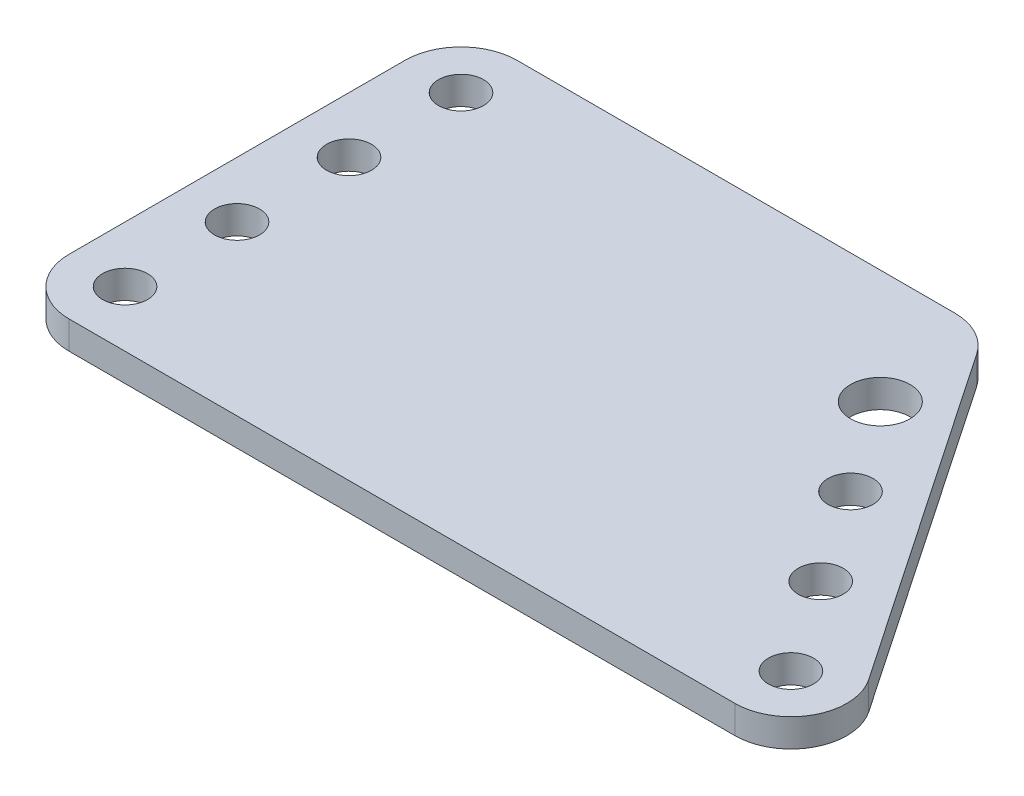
ISO-10303-21;
HEADER;
FILE_DESCRIPTION(('STEP AP214'),'2;1');
FILE_NAME('part.step','',(''),(''),'','','');
FILE_SCHEMA(('AUTOMOTIVE_DESIGN { 1 0 10303 214 1 1 1 1 }'));
ENDSEC;
DATA;
#1=APPLICATION_CONTEXT('core data for automotive mechanical design processes');
#2=APPLICATION_PROTOCOL_DEFINITION('international standard','automotive_design',2000,#1);
#3=PRODUCT_CONTEXT('',#1,'mechanical');
#4=PRODUCT('Part','Part','',(#3));
#5=PRODUCT_RELATED_PRODUCT_CATEGORY('part','',(#4));
#6=PRODUCT_DEFINITION_FORMATION('','',#4);
#7=PRODUCT_DEFINITION_CONTEXT('part definition',#1,'design');
#8=PRODUCT_DEFINITION('design','',#6,#7);
#9=PRODUCT_DEFINITION_SHAPE('','',#8);
#10=(LENGTH_UNIT() NAMED_UNIT(*) SI_UNIT(.MILLI.,.METRE.));
#11=(NAMED_UNIT(*) PLANE_ANGLE_UNIT() SI_UNIT($,.RADIAN.));
#12=(NAMED_UNIT(*) SI_UNIT($,.STERADIAN.) SOLID_ANGLE_UNIT());
#13=UNCERTAINTY_MEASURE_WITH_UNIT(LENGTH_MEASURE(1.E-05),#10,'distance_accuracy_value','');
#14=(GEOMETRIC_REPRESENTATION_CONTEXT(3) GLOBAL_UNCERTAINTY_ASSIGNED_CONTEXT((#13)) GLOBAL_UNIT_ASSIGNED_CONTEXT((#10,
#11,#12)) REPRESENTATION_CONTEXT('',''));
#15=CARTESIAN_POINT('',(0.,0.,0.));
#16=DIRECTION('',(0.,0.,1.));
#17=DIRECTION('',(1.,0.,0.));
#18=AXIS2_PLACEMENT_3D('',#15,#16,#17);
#19=CARTESIAN_POINT('',(6.35,0.,-6.35));
#20=DIRECTION('',(0.,-1.,0.));
#21=DIRECTION('',(0.,0.,-1.));
#22=AXIS2_PLACEMENT_3D('',#19,#20,#21);
#23=PLANE('',#22);
#24=CARTESIAN_POINT('',(60.4719283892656,0.,-37.8774597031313));
#25=DIRECTION('',(0.,1.,0.));
#26=DIRECTION('',(0.,0.,1.));
#27=AXIS2_PLACEMENT_3D('',#24,#25,#26);
#28=CIRCLE('',#27,3.37350099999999);
#29=CARTESIAN_POINT('',(60.4719283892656,0.,-34.5039587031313));
#30=VERTEX_POINT('',#29);
#31=EDGE_CURVE('E275',#30,#30,#28,.T.);
#32=ORIENTED_EDGE('',*,*,#31,.T.);
#33=EDGE_LOOP('',(#32));
#34=FACE_BOUND('',#33,.T.);
#35=CARTESIAN_POINT('',(6.35,0.,-44.45));
#36=DIRECTION('',(0.,1.,0.));
#37=DIRECTION('',(0.,0.,1.));
#38=AXIS2_PLACEMENT_3D('',#35,#36,#37);
#39=CIRCLE('',#38,2.55269999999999);
#40=CARTESIAN_POINT('',(6.35,0.,-41.8973));
#41=VERTEX_POINT('',#40);
#42=EDGE_CURVE('E267',#41,#41,#39,.T.);
#43=ORIENTED_EDGE('',*,*,#42,.T.);
#44=EDGE_LOOP('',(#43));
#45=FACE_BOUND('',#44,.T.);
#46=CARTESIAN_POINT('',(6.35000000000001,0.,-6.35));
#47=DIRECTION('',(0.,1.,0.));
#48=DIRECTION('',(0.,0.,1.));
#49=AXIS2_PLACEMENT_3D('',#46,#47,#48);
#50=CIRCLE('',#49,2.5527);
#51=CARTESIAN_POINT('',(6.35000000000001,0.,-3.7973));
#52=VERTEX_POINT('',#51);
#53=EDGE_CURVE('E259',#52,#52,#50,.T.);
#54=ORIENTED_EDGE('',*,*,#53,.T.);
#55=EDGE_LOOP('',(#54));
#56=FACE_BOUND('',#55,.T.);
#57=CARTESIAN_POINT('',(81.8642,0.,-6.35));
#58=DIRECTION('',(0.,1.,0.));
#59=DIRECTION('',(0.,0.,1.));
#60=AXIS2_PLACEMENT_3D('',#57,#58,#59);
#61=CIRCLE('',#60,2.55269999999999);
#62=CARTESIAN_POINT('',(81.8642,0.,-3.79730000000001));
#63=VERTEX_POINT('',#62);
#64=EDGE_CURVE('E251',#63,#63,#61,.T.);
#65=ORIENTED_EDGE('',*,*,#64,.T.);
#66=EDGE_LOOP('',(#65));
#67=FACE_BOUND('',#66,.T.);
#68=CARTESIAN_POINT('',(6.35,0.,-19.05));
#69=DIRECTION('',(0.,1.,0.));
#70=DIRECTION('',(0.,0.,1.));
#71=AXIS2_PLACEMENT_3D('',#68,#69,#70);
#72=CIRCLE('',#71,2.55269999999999);
#73=CARTESIAN_POINT('',(6.35,0.,-16.4973));
#74=VERTEX_POINT('',#73);
#75=EDGE_CURVE('E243',#74,#74,#72,.T.);
#76=ORIENTED_EDGE('',*,*,#75,.T.);
#77=EDGE_LOOP('',(#76));
#78=FACE_BOUND('',#77,.T.);
#79=CARTESIAN_POINT('',(6.35,0.,-31.75));
#80=DIRECTION('',(0.,1.,0.));
#81=DIRECTION('',(0.,0.,1.));
#82=AXIS2_PLACEMENT_3D('',#79,#80,#81);
#83=CIRCLE('',#82,2.5527);
#84=CARTESIAN_POINT('',(6.35,0.,-29.1973));
#85=VERTEX_POINT('',#84);
#86=EDGE_CURVE('E235',#85,#85,#83,.T.);
#87=ORIENTED_EDGE('',*,*,#86,.T.);
#88=EDGE_LOOP('',(#87));
#89=FACE_BOUND('',#88,.T.);
#90=CARTESIAN_POINT('',(67.6026855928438,0.,-27.3683064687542));
#91=DIRECTION('',(0.,1.,0.));
#92=DIRECTION('',(0.,0.,1.));
#93=AXIS2_PLACEMENT_3D('',#90,#91,#92);
#94=CIRCLE('',#93,2.55269999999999);
#95=CARTESIAN_POINT('',(67.6026855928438,0.,-24.8156064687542));
#96=VERTEX_POINT('',#95);
#97=EDGE_CURVE('E227',#96,#96,#94,.T.);
#98=ORIENTED_EDGE('',*,*,#97,.T.);
#99=EDGE_LOOP('',(#98));
#100=FACE_BOUND('',#99,.T.);
#101=CARTESIAN_POINT('',(6.35,0.,-6.35));
#102=DIRECTION('',(0.,1.,0.));
#103=DIRECTION('',(0.,0.,-1.));
#104=AXIS2_PLACEMENT_3D('',#101,#102,#103);
#105=CIRCLE('',#104,6.35);
#106=CARTESIAN_POINT('',(0.,0.,-6.35000000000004));
#107=VERTEX_POINT('',#106);
#108=CARTESIAN_POINT('',(6.35000000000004,0.,0.));
#109=VERTEX_POINT('',#108);
#110=EDGE_CURVE('E151',#107,#109,#105,.T.);
#111=ORIENTED_EDGE('',*,*,#110,.F.);
#112=DIRECTION('',(0.,0.,1.));
#113=VECTOR('',#112,1.);
#114=CARTESIAN_POINT('',(0.,0.,-44.45));
#115=LINE('',#114,#113);
#116=CARTESIAN_POINT('',(0.,0.,-44.45));
#117=VERTEX_POINT('',#116);
#118=EDGE_CURVE('E101',#117,#107,#115,.T.);
#119=ORIENTED_EDGE('',*,*,#118,.F.);
#120=CARTESIAN_POINT('',(6.35,0.,-44.45));
#121=DIRECTION('',(0.,1.,0.));
#122=DIRECTION('',(0.,0.,1.));
#123=AXIS2_PLACEMENT_3D('',#120,#121,#122);
#124=CIRCLE('',#123,6.35);
#125=CARTESIAN_POINT('',(6.35000000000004,0.,-50.8));
#126=VERTEX_POINT('',#125);
#127=EDGE_CURVE('E95',#126,#117,#124,.T.);
#128=ORIENTED_EDGE('',*,*,#127,.F.);
#129=DIRECTION('',(-1.,0.,0.));
#130=VECTOR('',#129,1.);
#131=CARTESIAN_POINT('',(56.0122742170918,0.,-50.8));
#132=LINE('',#131,#130);
#133=CARTESIAN_POINT('',(56.0122742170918,0.,-50.8));
#134=VERTEX_POINT('',#133);
#135=EDGE_CURVE('E137',#134,#126,#132,.T.);
#136=ORIENTED_EDGE('',*,*,#135,.F.);
#137=CARTESIAN_POINT('',(56.0122742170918,0.,-44.45));
#138=DIRECTION('',(0.,1.,0.));
#139=DIRECTION('',(0.,0.,1.));
#140=AXIS2_PLACEMENT_3D('',#137,#138,#139);
#141=CIRCLE('',#140,6.34999999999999);
#142=CARTESIAN_POINT('',(61.2668508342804,0.,-48.0153786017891));
#143=VERTEX_POINT('',#142);
#144=EDGE_CURVE('E165',#143,#134,#141,.T.);
#145=ORIENTED_EDGE('',*,*,#144,.F.);
#146=DIRECTION('',(-0.561476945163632,0.,-0.827492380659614));
#147=VECTOR('',#146,1.);
#148=CARTESIAN_POINT('',(87.1187766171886,0.,-9.91537860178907));
#149=LINE('',#148,#147);
#150=CARTESIAN_POINT('',(87.1187766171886,0.,-9.91537860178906));
#151=VERTEX_POINT('',#150);
#152=EDGE_CURVE('E162',#151,#143,#149,.T.);
#153=ORIENTED_EDGE('',*,*,#152,.F.);
#154=CARTESIAN_POINT('',(81.8642,0.,-6.35));
#155=DIRECTION('',(0.,1.,0.));
#156=DIRECTION('',(0.,0.,1.));
#157=AXIS2_PLACEMENT_3D('',#154,#155,#156);
#158=CIRCLE('',#157,6.35000000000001);
#159=CARTESIAN_POINT('',(81.8642,0.,0.));
#160=VERTEX_POINT('',#159);
#161=EDGE_CURVE('E159',#160,#151,#158,.T.);
#162=ORIENTED_EDGE('',*,*,#161,.F.);
#163=DIRECTION('',(1.,0.,0.));
#164=VECTOR('',#163,1.);
#165=CARTESIAN_POINT('',(6.35000000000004,0.,0.));
#166=LINE('',#165,#164);
#167=EDGE_CURVE('E155',#109,#160,#166,.T.);
#168=ORIENTED_EDGE('',*,*,#167,.F.);
#169=EDGE_LOOP('',(#111,#119,#128,#136,#145,#153,#162,#168));
#170=FACE_BOUND('',#169,.T.);
#171=CARTESIAN_POINT('',(74.7334427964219,0.,-16.8591532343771));
#172=DIRECTION('',(0.,1.,0.));
#173=DIRECTION('',(0.,0.,1.));
#174=AXIS2_PLACEMENT_3D('',#171,#172,#173);
#175=CIRCLE('',#174,2.55269999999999);
#176=CARTESIAN_POINT('',(74.7334427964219,0.,-14.3064532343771));
#177=VERTEX_POINT('',#176);
#178=EDGE_CURVE('E156',#177,#177,#175,.T.);
#179=ORIENTED_EDGE('',*,*,#178,.T.);
#180=EDGE_LOOP('',(#179));
#181=FACE_BOUND('',#180,.T.);
#182=ADVANCED_FACE('F48',(#34,#45,#56,#67,#78,#89,#100,#170,#181),#23,.T.);
#183=CARTESIAN_POINT('',(6.35,3.175,-6.35));
#184=DIRECTION('',(0.,-1.,0.));
#185=DIRECTION('',(0.,0.,-1.));
#186=AXIS2_PLACEMENT_3D('',#183,#184,#185);
#187=CYLINDRICAL_SURFACE('',#186,6.35);
#188=ORIENTED_EDGE('',*,*,#110,.T.);
#189=DIRECTION('',(0.,-1.,0.));
#190=VECTOR('',#189,1.);
#191=CARTESIAN_POINT('',(6.35000000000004,3.175,0.));
#192=LINE('',#191,#190);
#193=CARTESIAN_POINT('',(6.35000000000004,3.175,0.));
#194=VERTEX_POINT('',#193);
#195=EDGE_CURVE('E13',#194,#109,#192,.T.);
#196=ORIENTED_EDGE('',*,*,#195,.F.);
#197=CARTESIAN_POINT('',(6.35,3.175,-6.35));
#198=DIRECTION('',(0.,1.,0.));
#199=DIRECTION('',(0.,0.,-1.));
#200=AXIS2_PLACEMENT_3D('',#197,#198,#199);
#201=CIRCLE('',#200,6.35);
#202=CARTESIAN_POINT('',(0.,3.175,-6.35000000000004));
#203=VERTEX_POINT('',#202);
#204=EDGE_CURVE('E174',#203,#194,#201,.T.);
#205=ORIENTED_EDGE('',*,*,#204,.F.);
#206=DIRECTION('',(0.,-1.,0.));
#207=VECTOR('',#206,1.);
#208=CARTESIAN_POINT('',(0.,3.175,-6.35000000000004));
#209=LINE('',#208,#207);
#210=EDGE_CURVE('E147',#203,#107,#209,.T.);
#211=ORIENTED_EDGE('',*,*,#210,.T.);
#212=EDGE_LOOP('',(#188,#196,#205,#211));
#213=FACE_BOUND('',#212,.T.);
#214=ADVANCED_FACE('F50',(#213),#187,.T.);
#215=CARTESIAN_POINT('',(6.35000000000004,3.175,0.));
#216=DIRECTION('',(0.,0.,-1.));
#217=DIRECTION('',(-1.,0.,0.));
#218=AXIS2_PLACEMENT_3D('',#215,#216,#217);
#219=PLANE('',#218);
#220=ORIENTED_EDGE('',*,*,#167,.T.);
#221=DIRECTION('',(0.,-1.,0.));
#222=VECTOR('',#221,1.);
#223=CARTESIAN_POINT('',(81.8642,3.175,0.));
#224=LINE('',#223,#222);
#225=CARTESIAN_POINT('',(81.8642,3.175,0.));
#226=VERTEX_POINT('',#225);
#227=EDGE_CURVE('E58',#226,#160,#224,.T.);
#228=ORIENTED_EDGE('',*,*,#227,.F.);
#229=DIRECTION('',(1.,0.,0.));
#230=VECTOR('',#229,1.);
#231=CARTESIAN_POINT('',(6.35000000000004,3.175,0.));
#232=LINE('',#231,#230);
#233=EDGE_CURVE('E109',#194,#226,#232,.T.);
#234=ORIENTED_EDGE('',*,*,#233,.F.);
#235=ORIENTED_EDGE('',*,*,#195,.T.);
#236=EDGE_LOOP('',(#220,#228,#234,#235));
#237=FACE_BOUND('',#236,.T.);
#238=ADVANCED_FACE('F323',(#237),#219,.F.);
#239=CARTESIAN_POINT('',(81.8642,3.175,-6.35));
#240=DIRECTION('',(0.,-1.,0.));
#241=DIRECTION('',(0.,0.,-1.));
#242=AXIS2_PLACEMENT_3D('',#239,#240,#241);
#243=CYLINDRICAL_SURFACE('',#242,6.35000000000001);
#244=ORIENTED_EDGE('',*,*,#161,.T.);
#245=DIRECTION('',(0.,-1.,0.));
#246=VECTOR('',#245,1.);
#247=CARTESIAN_POINT('',(87.1187766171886,3.175,-9.91537860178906));
#248=LINE('',#247,#246);
#249=CARTESIAN_POINT('',(87.1187766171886,3.175,-9.91537860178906));
#250=VERTEX_POINT('',#249);
#251=EDGE_CURVE('E185',#250,#151,#248,.T.);
#252=ORIENTED_EDGE('',*,*,#251,.F.);
#253=CARTESIAN_POINT('',(81.8642,3.175,-6.35));
#254=DIRECTION('',(0.,1.,0.));
#255=DIRECTION('',(0.,0.,1.));
#256=AXIS2_PLACEMENT_3D('',#253,#254,#255);
#257=CIRCLE('',#256,6.35000000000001);
#258=EDGE_CURVE('E196',#226,#250,#257,.T.);
#259=ORIENTED_EDGE('',*,*,#258,.F.);
#260=ORIENTED_EDGE('',*,*,#227,.T.);
#261=EDGE_LOOP('',(#244,#252,#259,#260));
#262=FACE_BOUND('',#261,.T.);
#263=ADVANCED_FACE('F194',(#262),#243,.T.);
#264=CARTESIAN_POINT('',(87.1187766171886,3.175,-9.91537860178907));
#265=DIRECTION('',(-0.827492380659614,0.,0.561476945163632));
#266=DIRECTION('',(0.561476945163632,0.,0.827492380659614));
#267=AXIS2_PLACEMENT_3D('',#264,#265,#266);
#268=PLANE('',#267);
#269=ORIENTED_EDGE('',*,*,#152,.T.);
#270=DIRECTION('',(0.,-1.,0.));
#271=VECTOR('',#270,1.);
#272=CARTESIAN_POINT('',(61.2668508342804,3.175,-48.0153786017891));
#273=LINE('',#272,#271);
#274=CARTESIAN_POINT('',(61.2668508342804,3.175,-48.0153786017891));
#275=VERTEX_POINT('',#274);
#276=EDGE_CURVE('E181',#275,#143,#273,.T.);
#277=ORIENTED_EDGE('',*,*,#276,.F.);
#278=DIRECTION('',(-0.561476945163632,0.,-0.827492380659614));
#279=VECTOR('',#278,1.);
#280=CARTESIAN_POINT('',(87.1187766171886,3.175,-9.91537860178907));
#281=LINE('',#280,#279);
#282=EDGE_CURVE('E209',#250,#275,#281,.T.);
#283=ORIENTED_EDGE('',*,*,#282,.F.);
#284=ORIENTED_EDGE('',*,*,#251,.T.);
#285=EDGE_LOOP('',(#269,#277,#283,#284));
#286=FACE_BOUND('',#285,.T.);
#287=ADVANCED_FACE('F204',(#286),#268,.F.);
#288=CARTESIAN_POINT('',(56.0122742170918,3.175,-44.45));
#289=DIRECTION('',(0.,-1.,0.));
#290=DIRECTION('',(0.,0.,-1.));
#291=AXIS2_PLACEMENT_3D('',#288,#289,#290);
#292=CYLINDRICAL_SURFACE('',#291,6.34999999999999);
#293=ORIENTED_EDGE('',*,*,#144,.T.);
#294=DIRECTION('',(0.,-1.,0.));
#295=VECTOR('',#294,1.);
#296=CARTESIAN_POINT('',(56.0122742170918,3.175,-50.8));
#297=LINE('',#296,#295);
#298=CARTESIAN_POINT('',(56.0122742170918,3.175,-50.8));
#299=VERTEX_POINT('',#298);
#300=EDGE_CURVE('E139',#299,#134,#297,.T.);
#301=ORIENTED_EDGE('',*,*,#300,.F.);
#302=CARTESIAN_POINT('',(56.0122742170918,3.175,-44.45));
#303=DIRECTION('',(0.,1.,0.));
#304=DIRECTION('',(0.,0.,1.));
#305=AXIS2_PLACEMENT_3D('',#302,#303,#304);
#306=CIRCLE('',#305,6.34999999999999);
#307=EDGE_CURVE('E128',#275,#299,#306,.T.);
#308=ORIENTED_EDGE('',*,*,#307,.F.);
#309=ORIENTED_EDGE('',*,*,#276,.T.);
#310=EDGE_LOOP('',(#293,#301,#308,#309));
#311=FACE_BOUND('',#310,.T.);
#312=ADVANCED_FACE('F207',(#311),#292,.T.);
#313=CARTESIAN_POINT('',(56.0122742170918,3.175,-50.8));
#314=DIRECTION('',(0.,0.,1.));
#315=DIRECTION('',(1.,0.,0.));
#316=AXIS2_PLACEMENT_3D('',#313,#314,#315);
#317=PLANE('',#316);
#318=ORIENTED_EDGE('',*,*,#135,.T.);
#319=DIRECTION('',(0.,-1.,0.));
#320=VECTOR('',#319,1.);
#321=CARTESIAN_POINT('',(6.35000000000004,3.175,-50.8));
#322=LINE('',#321,#320);
#323=CARTESIAN_POINT('',(6.35000000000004,3.175,-50.8));
#324=VERTEX_POINT('',#323);
#325=EDGE_CURVE('E134',#324,#126,#322,.T.);
#326=ORIENTED_EDGE('',*,*,#325,.F.);
#327=DIRECTION('',(-1.,0.,0.));
#328=VECTOR('',#327,1.);
#329=CARTESIAN_POINT('',(56.0122742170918,3.175,-50.8));
#330=LINE('',#329,#328);
#331=EDGE_CURVE('E122',#299,#324,#330,.T.);
#332=ORIENTED_EDGE('',*,*,#331,.F.);
#333=ORIENTED_EDGE('',*,*,#300,.T.);
#334=EDGE_LOOP('',(#318,#326,#332,#333));
#335=FACE_BOUND('',#334,.T.);
#336=ADVANCED_FACE('F135',(#335),#317,.F.);
#337=CARTESIAN_POINT('',(6.35,3.175,-44.45));
#338=DIRECTION('',(0.,-1.,0.));
#339=DIRECTION('',(0.,0.,-1.));
#340=AXIS2_PLACEMENT_3D('',#337,#338,#339);
#341=CYLINDRICAL_SURFACE('',#340,6.35);
#342=ORIENTED_EDGE('',*,*,#127,.T.);
#343=DIRECTION('',(0.,-1.,0.));
#344=VECTOR('',#343,1.);
#345=CARTESIAN_POINT('',(0.,3.175,-44.45));
#346=LINE('',#345,#344);
#347=CARTESIAN_POINT('',(0.,3.175,-44.45));
#348=VERTEX_POINT('',#347);
#349=EDGE_CURVE('E140',#348,#117,#346,.T.);
#350=ORIENTED_EDGE('',*,*,#349,.F.);
#351=CARTESIAN_POINT('',(6.35,3.175,-44.45));
#352=DIRECTION('',(0.,1.,0.));
#353=DIRECTION('',(0.,0.,1.));
#354=AXIS2_PLACEMENT_3D('',#351,#352,#353);
#355=CIRCLE('',#354,6.35);
#356=EDGE_CURVE('E126',#324,#348,#355,.T.);
#357=ORIENTED_EDGE('',*,*,#356,.F.);
#358=ORIENTED_EDGE('',*,*,#325,.T.);
#359=EDGE_LOOP('',(#342,#350,#357,#358));
#360=FACE_BOUND('',#359,.T.);
#361=ADVANCED_FACE('F142',(#360),#341,.T.);
#362=CARTESIAN_POINT('',(0.,3.175,-44.45));
#363=DIRECTION('',(1.,0.,0.));
#364=DIRECTION('',(0.,0.,-1.));
#365=AXIS2_PLACEMENT_3D('',#362,#363,#364);
#366=PLANE('',#365);
#367=ORIENTED_EDGE('',*,*,#118,.T.);
#368=ORIENTED_EDGE('',*,*,#210,.F.);
#369=DIRECTION('',(0.,0.,1.));
#370=VECTOR('',#369,1.);
#371=CARTESIAN_POINT('',(0.,3.175,-44.45));
#372=LINE('',#371,#370);
#373=EDGE_CURVE('E66',#348,#203,#372,.T.);
#374=ORIENTED_EDGE('',*,*,#373,.F.);
#375=ORIENTED_EDGE('',*,*,#349,.T.);
#376=EDGE_LOOP('',(#367,#368,#374,#375));
#377=FACE_BOUND('',#376,.T.);
#378=ADVANCED_FACE('F290',(#377),#366,.F.);
#379=CARTESIAN_POINT('',(6.35,3.175,-6.35));
#380=DIRECTION('',(0.,-1.,0.));
#381=DIRECTION('',(0.,0.,-1.));
#382=AXIS2_PLACEMENT_3D('',#379,#380,#381);
#383=PLANE('',#382);
#384=CARTESIAN_POINT('',(60.4719283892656,3.175,-37.8774597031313));
#385=DIRECTION('',(0.,1.,0.));
#386=DIRECTION('',(0.,0.,1.));
#387=AXIS2_PLACEMENT_3D('',#384,#385,#386);
#388=CIRCLE('',#387,3.37350099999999);
#389=CARTESIAN_POINT('',(60.4719283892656,3.175,-34.5039587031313));
#390=VERTEX_POINT('',#389);
#391=EDGE_CURVE('E279',#390,#390,#388,.T.);
#392=ORIENTED_EDGE('',*,*,#391,.F.);
#393=EDGE_LOOP('',(#392));
#394=FACE_BOUND('',#393,.T.);
#395=CARTESIAN_POINT('',(6.35,3.175,-44.45));
#396=DIRECTION('',(0.,1.,0.));
#397=DIRECTION('',(0.,0.,1.));
#398=AXIS2_PLACEMENT_3D('',#395,#396,#397);
#399=CIRCLE('',#398,2.55269999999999);
#400=CARTESIAN_POINT('',(6.35,3.175,-41.8973));
#401=VERTEX_POINT('',#400);
#402=EDGE_CURVE('E271',#401,#401,#399,.T.);
#403=ORIENTED_EDGE('',*,*,#402,.F.);
#404=EDGE_LOOP('',(#403));
#405=FACE_BOUND('',#404,.T.);
#406=CARTESIAN_POINT('',(6.35000000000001,3.175,-6.35));
#407=DIRECTION('',(0.,1.,0.));
#408=DIRECTION('',(0.,0.,1.));
#409=AXIS2_PLACEMENT_3D('',#406,#407,#408);
#410=CIRCLE('',#409,2.55269999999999);
#411=CARTESIAN_POINT('',(6.35000000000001,3.175,-3.79730000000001));
#412=VERTEX_POINT('',#411);
#413=EDGE_CURVE('E263',#412,#412,#410,.T.);
#414=ORIENTED_EDGE('',*,*,#413,.F.);
#415=EDGE_LOOP('',(#414));
#416=FACE_BOUND('',#415,.T.);
#417=CARTESIAN_POINT('',(81.8642,3.175,-6.35));
#418=DIRECTION('',(0.,1.,0.));
#419=DIRECTION('',(0.,0.,1.));
#420=AXIS2_PLACEMENT_3D('',#417,#418,#419);
#421=CIRCLE('',#420,2.55269999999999);
#422=CARTESIAN_POINT('',(81.8642,3.175,-3.79730000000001));
#423=VERTEX_POINT('',#422);
#424=EDGE_CURVE('E255',#423,#423,#421,.T.);
#425=ORIENTED_EDGE('',*,*,#424,.F.);
#426=EDGE_LOOP('',(#425));
#427=FACE_BOUND('',#426,.T.);
#428=CARTESIAN_POINT('',(6.35,3.175,-19.05));
#429=DIRECTION('',(0.,1.,0.));
#430=DIRECTION('',(0.,0.,1.));
#431=AXIS2_PLACEMENT_3D('',#428,#429,#430);
#432=CIRCLE('',#431,2.55269999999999);
#433=CARTESIAN_POINT('',(6.35,3.175,-16.4973));
#434=VERTEX_POINT('',#433);
#435=EDGE_CURVE('E247',#434,#434,#432,.T.);
#436=ORIENTED_EDGE('',*,*,#435,.F.);
#437=EDGE_LOOP('',(#436));
#438=FACE_BOUND('',#437,.T.);
#439=CARTESIAN_POINT('',(6.35,3.175,-31.75));
#440=DIRECTION('',(0.,1.,0.));
#441=DIRECTION('',(0.,0.,1.));
#442=AXIS2_PLACEMENT_3D('',#439,#440,#441);
#443=CIRCLE('',#442,2.55269999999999);
#444=CARTESIAN_POINT('',(6.35,3.175,-29.1973));
#445=VERTEX_POINT('',#444);
#446=EDGE_CURVE('E239',#445,#445,#443,.T.);
#447=ORIENTED_EDGE('',*,*,#446,.F.);
#448=EDGE_LOOP('',(#447));
#449=FACE_BOUND('',#448,.T.);
#450=CARTESIAN_POINT('',(67.6026855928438,3.175,-27.3683064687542));
#451=DIRECTION('',(0.,1.,0.));
#452=DIRECTION('',(0.,0.,1.));
#453=AXIS2_PLACEMENT_3D('',#450,#451,#452);
#454=CIRCLE('',#453,2.55269999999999);
#455=CARTESIAN_POINT('',(67.6026855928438,3.175,-24.8156064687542));
#456=VERTEX_POINT('',#455);
#457=EDGE_CURVE('E231',#456,#456,#454,.T.);
#458=ORIENTED_EDGE('',*,*,#457,.F.);
#459=EDGE_LOOP('',(#458));
#460=FACE_BOUND('',#459,.T.);
#461=CARTESIAN_POINT('',(74.7334427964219,3.175,-16.8591532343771));
#462=DIRECTION('',(0.,1.,0.));
#463=DIRECTION('',(0.,0.,1.));
#464=AXIS2_PLACEMENT_3D('',#461,#462,#463);
#465=CIRCLE('',#464,2.55269999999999);
#466=CARTESIAN_POINT('',(74.7334427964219,3.175,-14.3064532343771));
#467=VERTEX_POINT('',#466);
#468=EDGE_CURVE('E223',#467,#467,#465,.T.);
#469=ORIENTED_EDGE('',*,*,#468,.F.);
#470=EDGE_LOOP('',(#469));
#471=FACE_BOUND('',#470,.T.);
#472=ORIENTED_EDGE('',*,*,#204,.T.);
#473=ORIENTED_EDGE('',*,*,#233,.T.);
#474=ORIENTED_EDGE('',*,*,#258,.T.);
#475=ORIENTED_EDGE('',*,*,#282,.T.);
#476=ORIENTED_EDGE('',*,*,#307,.T.);
#477=ORIENTED_EDGE('',*,*,#331,.T.);
#478=ORIENTED_EDGE('',*,*,#356,.T.);
#479=ORIENTED_EDGE('',*,*,#373,.T.);
#480=EDGE_LOOP('',(#472,#473,#474,#475,#476,#477,#478,#479));
#481=FACE_BOUND('',#480,.T.);
#482=ADVANCED_FACE('F124',(#394,#405,#416,#427,#438,#449,#460,#471,#481),#383,.F.);
#483=CARTESIAN_POINT('',(74.7334427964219,3.175,-16.8591532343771));
#484=DIRECTION('',(0.,1.,0.));
#485=DIRECTION('',(0.,0.,1.));
#486=AXIS2_PLACEMENT_3D('',#483,#484,#485);
#487=CYLINDRICAL_SURFACE('',#486,2.55269999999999);
#488=ORIENTED_EDGE('',*,*,#178,.F.);
#489=EDGE_LOOP('',(#488));
#490=FACE_BOUND('',#489,.T.);
#491=ORIENTED_EDGE('',*,*,#468,.T.);
#492=EDGE_LOOP('',(#491));
#493=FACE_BOUND('',#492,.T.);
#494=ADVANCED_FACE('F289',(#490,#493),#487,.F.);
#495=CARTESIAN_POINT('',(67.6026855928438,3.175,-27.3683064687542));
#496=DIRECTION('',(0.,1.,0.));
#497=DIRECTION('',(0.,0.,1.));
#498=AXIS2_PLACEMENT_3D('',#495,#496,#497);
#499=CYLINDRICAL_SURFACE('',#498,2.55269999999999);
#500=ORIENTED_EDGE('',*,*,#97,.F.);
#501=EDGE_LOOP('',(#500));
#502=FACE_BOUND('',#501,.T.);
#503=ORIENTED_EDGE('',*,*,#457,.T.);
#504=EDGE_LOOP('',(#503));
#505=FACE_BOUND('',#504,.T.);
#506=ADVANCED_FACE('F307',(#502,#505),#499,.F.);
#507=CARTESIAN_POINT('',(6.35,3.175,-31.75));
#508=DIRECTION('',(0.,1.,0.));
#509=DIRECTION('',(0.,0.,1.));
#510=AXIS2_PLACEMENT_3D('',#507,#508,#509);
#511=CYLINDRICAL_SURFACE('',#510,2.55269999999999);
#512=ORIENTED_EDGE('',*,*,#86,.F.);
#513=EDGE_LOOP('',(#512));
#514=FACE_BOUND('',#513,.T.);
#515=ORIENTED_EDGE('',*,*,#446,.T.);
#516=EDGE_LOOP('',(#515));
#517=FACE_BOUND('',#516,.T.);
#518=ADVANCED_FACE('F313',(#514,#517),#511,.F.);
#519=CARTESIAN_POINT('',(6.35,3.175,-19.05));
#520=DIRECTION('',(0.,1.,0.));
#521=DIRECTION('',(0.,0.,1.));
#522=AXIS2_PLACEMENT_3D('',#519,#520,#521);
#523=CYLINDRICAL_SURFACE('',#522,2.55269999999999);
#524=ORIENTED_EDGE('',*,*,#75,.F.);
#525=EDGE_LOOP('',(#524));
#526=FACE_BOUND('',#525,.T.);
#527=ORIENTED_EDGE('',*,*,#435,.T.);
#528=EDGE_LOOP('',(#527));
#529=FACE_BOUND('',#528,.T.);
#530=ADVANCED_FACE('F416',(#526,#529),#523,.F.);
#531=CARTESIAN_POINT('',(81.8642,3.175,-6.35));
#532=DIRECTION('',(0.,1.,0.));
#533=DIRECTION('',(0.,0.,1.));
#534=AXIS2_PLACEMENT_3D('',#531,#532,#533);
#535=CYLINDRICAL_SURFACE('',#534,2.55269999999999);
#536=ORIENTED_EDGE('',*,*,#64,.F.);
#537=EDGE_LOOP('',(#536));
#538=FACE_BOUND('',#537,.T.);
#539=ORIENTED_EDGE('',*,*,#424,.T.);
#540=EDGE_LOOP('',(#539));
#541=FACE_BOUND('',#540,.T.);
#542=ADVANCED_FACE('F406',(#538,#541),#535,.F.);
#543=CARTESIAN_POINT('',(6.35000000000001,3.175,-6.35));
#544=DIRECTION('',(0.,1.,0.));
#545=DIRECTION('',(0.,0.,1.));
#546=AXIS2_PLACEMENT_3D('',#543,#544,#545);
#547=CYLINDRICAL_SURFACE('',#546,2.55269999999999);
#548=ORIENTED_EDGE('',*,*,#53,.F.);
#549=EDGE_LOOP('',(#548));
#550=FACE_BOUND('',#549,.T.);
#551=ORIENTED_EDGE('',*,*,#413,.T.);
#552=EDGE_LOOP('',(#551));
#553=FACE_BOUND('',#552,.T.);
#554=ADVANCED_FACE('F397',(#550,#553),#547,.F.);
#555=CARTESIAN_POINT('',(6.35,3.175,-44.45));
#556=DIRECTION('',(0.,1.,0.));
#557=DIRECTION('',(0.,0.,1.));
#558=AXIS2_PLACEMENT_3D('',#555,#556,#557);
#559=CYLINDRICAL_SURFACE('',#558,2.55269999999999);
#560=ORIENTED_EDGE('',*,*,#42,.F.);
#561=EDGE_LOOP('',(#560));
#562=FACE_BOUND('',#561,.T.);
#563=ORIENTED_EDGE('',*,*,#402,.T.);
#564=EDGE_LOOP('',(#563));
#565=FACE_BOUND('',#564,.T.);
#566=ADVANCED_FACE('F385',(#562,#565),#559,.F.);
#567=CARTESIAN_POINT('',(60.4719283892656,3.175,-37.8774597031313));
#568=DIRECTION('',(0.,1.,0.));
#569=DIRECTION('',(0.,0.,1.));
#570=AXIS2_PLACEMENT_3D('',#567,#568,#569);
#571=CYLINDRICAL_SURFACE('',#570,3.37350099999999);
#572=ORIENTED_EDGE('',*,*,#31,.F.);
#573=EDGE_LOOP('',(#572));
#574=FACE_BOUND('',#573,.T.);
#575=ORIENTED_EDGE('',*,*,#391,.T.);
#576=EDGE_LOOP('',(#575));
#577=FACE_BOUND('',#576,.T.);
#578=ADVANCED_FACE('F285',(#574,#577),#571,.F.);
#579=CLOSED_SHELL('',(#182,#214,#238,#263,#287,#312,#336,#361,#378,#482,#494,#506,#518,#530,
#542,#554,#566,#578));
#580=MANIFOLD_SOLID_BREP('B2',#579);
#581=ADVANCED_BREP_SHAPE_REPRESENTATION('',(#18,#580),#14);
#582=SHAPE_DEFINITION_REPRESENTATION(#9,#581);
ENDSEC;
END-ISO-10303-21;
